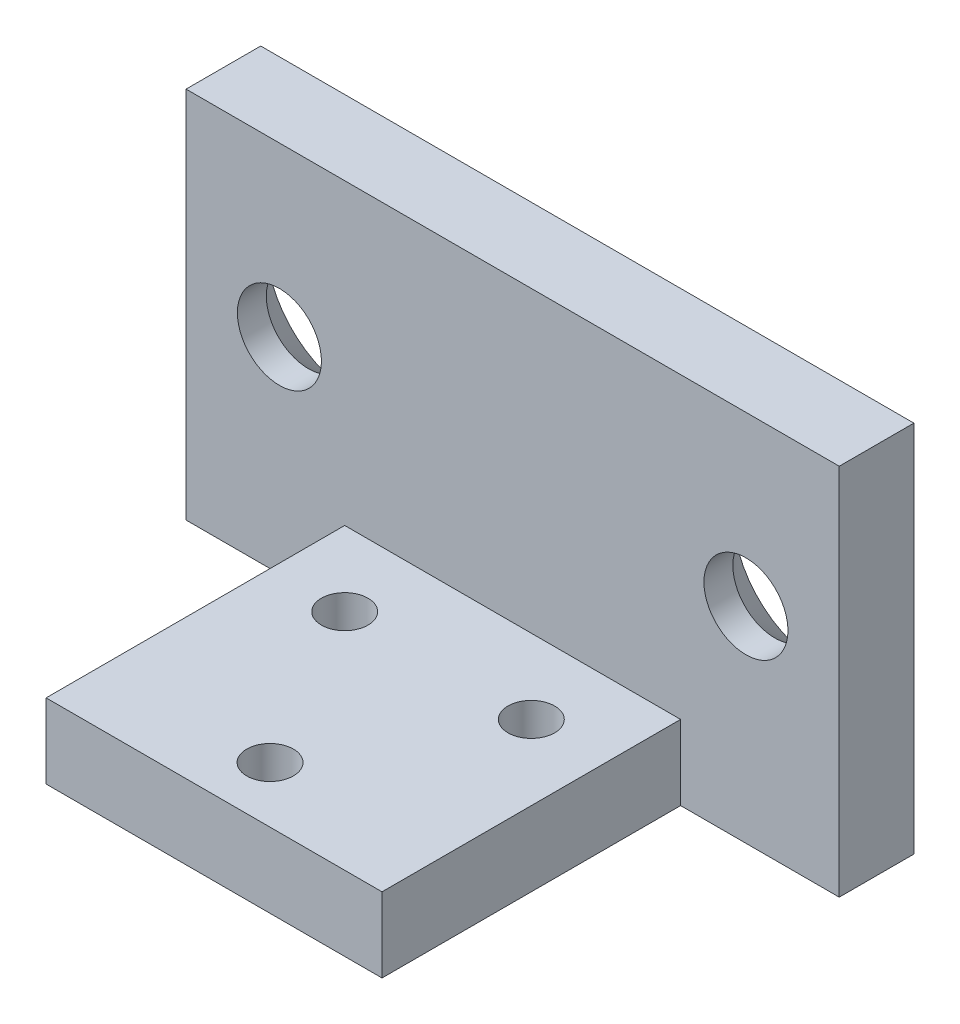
ISO-10303-21;
HEADER;
FILE_DESCRIPTION(('STEP AP214'),'2;1');
FILE_NAME('part.step','',(''),(''),'','','');
FILE_SCHEMA(('AUTOMOTIVE_DESIGN { 1 0 10303 214 1 1 1 1 }'));
ENDSEC;
DATA;
#1=APPLICATION_CONTEXT('core data for automotive mechanical design processes');
#2=APPLICATION_PROTOCOL_DEFINITION('international standard','automotive_design',2000,#1);
#3=PRODUCT_CONTEXT('',#1,'mechanical');
#4=PRODUCT('Part','Part','',(#3));
#5=PRODUCT_RELATED_PRODUCT_CATEGORY('part','',(#4));
#6=PRODUCT_DEFINITION_FORMATION('','',#4);
#7=PRODUCT_DEFINITION_CONTEXT('part definition',#1,'design');
#8=PRODUCT_DEFINITION('design','',#6,#7);
#9=PRODUCT_DEFINITION_SHAPE('','',#8);
#10=(LENGTH_UNIT() NAMED_UNIT(*) SI_UNIT(.MILLI.,.METRE.));
#11=(NAMED_UNIT(*) PLANE_ANGLE_UNIT() SI_UNIT($,.RADIAN.));
#12=(NAMED_UNIT(*) SI_UNIT($,.STERADIAN.) SOLID_ANGLE_UNIT());
#13=UNCERTAINTY_MEASURE_WITH_UNIT(LENGTH_MEASURE(1.E-05),#10,'distance_accuracy_value','');
#14=(GEOMETRIC_REPRESENTATION_CONTEXT(3) GLOBAL_UNCERTAINTY_ASSIGNED_CONTEXT((#13)) GLOBAL_UNIT_ASSIGNED_CONTEXT((#10,
#11,#12)) REPRESENTATION_CONTEXT('',''));
#15=CARTESIAN_POINT('',(0.,0.,0.));
#16=DIRECTION('',(0.,0.,1.));
#17=DIRECTION('',(1.,0.,0.));
#18=AXIS2_PLACEMENT_3D('',#15,#16,#17);
#19=CARTESIAN_POINT('',(0.,20.,4.));
#20=DIRECTION('',(0.,0.,-1.));
#21=DIRECTION('',(-1.,0.,0.));
#22=AXIS2_PLACEMENT_3D('',#19,#20,#21);
#23=PLANE('',#22);
#24=CARTESIAN_POINT('',(5.00000000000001,11.,4.));
#25=DIRECTION('',(0.,0.,-1.));
#26=DIRECTION('',(-1.,0.,0.));
#27=AXIS2_PLACEMENT_3D('',#24,#25,#26);
#28=CIRCLE('',#27,2.25);
#29=CARTESIAN_POINT('',(2.75000000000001,11.,4.));
#30=VERTEX_POINT('',#29);
#31=EDGE_CURVE('E238',#30,#30,#28,.T.);
#32=ORIENTED_EDGE('',*,*,#31,.T.);
#33=EDGE_LOOP('',(#32));
#34=FACE_BOUND('',#33,.T.);
#35=CARTESIAN_POINT('',(30.,11.,4.));
#36=DIRECTION('',(0.,0.,-1.));
#37=DIRECTION('',(-1.,0.,0.));
#38=AXIS2_PLACEMENT_3D('',#35,#36,#37);
#39=CIRCLE('',#38,2.25);
#40=CARTESIAN_POINT('',(27.75,11.,4.));
#41=VERTEX_POINT('',#40);
#42=EDGE_CURVE('E174',#41,#41,#39,.T.);
#43=ORIENTED_EDGE('',*,*,#42,.T.);
#44=EDGE_LOOP('',(#43));
#45=FACE_BOUND('',#44,.T.);
#46=DIRECTION('',(0.,-1.,0.));
#47=VECTOR('',#46,1.);
#48=CARTESIAN_POINT('',(8.50000000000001,0.,4.));
#49=LINE('',#48,#47);
#50=CARTESIAN_POINT('',(8.50000000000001,4.00000000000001,4.));
#51=VERTEX_POINT('',#50);
#52=CARTESIAN_POINT('',(8.50000000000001,0.,4.));
#53=VERTEX_POINT('',#52);
#54=EDGE_CURVE('E47',#51,#53,#49,.T.);
#55=ORIENTED_EDGE('',*,*,#54,.F.);
#56=DIRECTION('',(-1.,0.,0.));
#57=VECTOR('',#56,1.);
#58=CARTESIAN_POINT('',(8.50000000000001,4.00000000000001,4.));
#59=LINE('',#58,#57);
#60=CARTESIAN_POINT('',(26.5,4.00000000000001,4.));
#61=VERTEX_POINT('',#60);
#62=EDGE_CURVE('E93',#61,#51,#59,.T.);
#63=ORIENTED_EDGE('',*,*,#62,.F.);
#64=DIRECTION('',(0.,1.,0.));
#65=VECTOR('',#64,1.);
#66=CARTESIAN_POINT('',(26.5,0.,4.));
#67=LINE('',#66,#65);
#68=CARTESIAN_POINT('',(26.5,0.,4.));
#69=VERTEX_POINT('',#68);
#70=EDGE_CURVE('E53',#69,#61,#67,.T.);
#71=ORIENTED_EDGE('',*,*,#70,.F.);
#72=DIRECTION('',(1.,0.,0.));
#73=VECTOR('',#72,1.);
#74=CARTESIAN_POINT('',(0.,0.,4.));
#75=LINE('',#74,#73);
#76=CARTESIAN_POINT('',(35.,0.,3.99999999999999));
#77=VERTEX_POINT('',#76);
#78=EDGE_CURVE('E131',#69,#77,#75,.T.);
#79=ORIENTED_EDGE('',*,*,#78,.T.);
#80=DIRECTION('',(0.,1.,0.));
#81=VECTOR('',#80,1.);
#82=CARTESIAN_POINT('',(35.,0.,3.99999999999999));
#83=LINE('',#82,#81);
#84=CARTESIAN_POINT('',(35.,20.,4.));
#85=VERTEX_POINT('',#84);
#86=EDGE_CURVE('E134',#77,#85,#83,.T.);
#87=ORIENTED_EDGE('',*,*,#86,.T.);
#88=DIRECTION('',(-1.,0.,0.));
#89=VECTOR('',#88,1.);
#90=CARTESIAN_POINT('',(0.,20.,4.));
#91=LINE('',#90,#89);
#92=CARTESIAN_POINT('',(0.,20.,4.));
#93=VERTEX_POINT('',#92);
#94=EDGE_CURVE('E148',#85,#93,#91,.T.);
#95=ORIENTED_EDGE('',*,*,#94,.T.);
#96=DIRECTION('',(0.,-1.,0.));
#97=VECTOR('',#96,1.);
#98=CARTESIAN_POINT('',(0.,0.,4.));
#99=LINE('',#98,#97);
#100=CARTESIAN_POINT('',(0.,0.,4.));
#101=VERTEX_POINT('',#100);
#102=EDGE_CURVE('E128',#93,#101,#99,.T.);
#103=ORIENTED_EDGE('',*,*,#102,.T.);
#104=EDGE_CURVE('E139',#101,#53,#75,.T.);
#105=ORIENTED_EDGE('',*,*,#104,.T.);
#106=EDGE_LOOP('',(#55,#63,#71,#79,#87,#95,#103,#105));
#107=FACE_BOUND('',#106,.T.);
#108=ADVANCED_FACE('F30',(#34,#45,#107),#23,.F.);
#109=CARTESIAN_POINT('',(0.,0.,4.));
#110=DIRECTION('',(1.,0.,0.));
#111=DIRECTION('',(0.,0.,-1.));
#112=AXIS2_PLACEMENT_3D('',#109,#110,#111);
#113=PLANE('',#112);
#114=DIRECTION('',(0.,-1.,0.));
#115=VECTOR('',#114,1.);
#116=CARTESIAN_POINT('',(0.,0.,0.));
#117=LINE('',#116,#115);
#118=CARTESIAN_POINT('',(0.,20.,0.));
#119=VERTEX_POINT('',#118);
#120=CARTESIAN_POINT('',(0.,0.,0.));
#121=VERTEX_POINT('',#120);
#122=EDGE_CURVE('E119',#119,#121,#117,.T.);
#123=ORIENTED_EDGE('',*,*,#122,.T.);
#124=DIRECTION('',(0.,0.,-1.));
#125=VECTOR('',#124,1.);
#126=CARTESIAN_POINT('',(0.,0.,4.));
#127=LINE('',#126,#125);
#128=EDGE_CURVE('E11',#101,#121,#127,.T.);
#129=ORIENTED_EDGE('',*,*,#128,.F.);
#130=ORIENTED_EDGE('',*,*,#102,.F.);
#131=DIRECTION('',(0.,0.,-1.));
#132=VECTOR('',#131,1.);
#133=CARTESIAN_POINT('',(0.,20.,4.));
#134=LINE('',#133,#132);
#135=EDGE_CURVE('E146',#93,#119,#134,.T.);
#136=ORIENTED_EDGE('',*,*,#135,.T.);
#137=EDGE_LOOP('',(#123,#129,#130,#136));
#138=FACE_BOUND('',#137,.T.);
#139=ADVANCED_FACE('F32',(#138),#113,.F.);
#140=CARTESIAN_POINT('',(0.,0.,4.));
#141=DIRECTION('',(0.,1.,0.));
#142=DIRECTION('',(0.,0.,1.));
#143=AXIS2_PLACEMENT_3D('',#140,#141,#142);
#144=PLANE('',#143);
#145=CARTESIAN_POINT('',(12.5,0.,8.));
#146=DIRECTION('',(0.,1.,0.));
#147=DIRECTION('',(0.,0.,1.));
#148=AXIS2_PLACEMENT_3D('',#145,#146,#147);
#149=CIRCLE('',#148,1.25);
#150=CARTESIAN_POINT('',(12.5,0.,9.25));
#151=VERTEX_POINT('',#150);
#152=EDGE_CURVE('E34',#151,#151,#149,.T.);
#153=ORIENTED_EDGE('',*,*,#152,.T.);
#154=EDGE_LOOP('',(#153));
#155=FACE_BOUND('',#154,.T.);
#156=CARTESIAN_POINT('',(22.5,0.,7.99999999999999));
#157=DIRECTION('',(0.,1.,0.));
#158=DIRECTION('',(0.,0.,1.));
#159=AXIS2_PLACEMENT_3D('',#156,#157,#158);
#160=CIRCLE('',#159,1.25);
#161=CARTESIAN_POINT('',(22.5,0.,9.24999999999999));
#162=VERTEX_POINT('',#161);
#163=EDGE_CURVE('E225',#162,#162,#160,.T.);
#164=ORIENTED_EDGE('',*,*,#163,.T.);
#165=EDGE_LOOP('',(#164));
#166=FACE_BOUND('',#165,.T.);
#167=CARTESIAN_POINT('',(17.5,0.,17.));
#168=DIRECTION('',(0.,1.,0.));
#169=DIRECTION('',(0.,0.,1.));
#170=AXIS2_PLACEMENT_3D('',#167,#168,#169);
#171=CIRCLE('',#170,1.25);
#172=CARTESIAN_POINT('',(17.5,0.,18.25));
#173=VERTEX_POINT('',#172);
#174=EDGE_CURVE('E228',#173,#173,#171,.T.);
#175=ORIENTED_EDGE('',*,*,#174,.T.);
#176=EDGE_LOOP('',(#175));
#177=FACE_BOUND('',#176,.T.);
#178=DIRECTION('',(1.,0.,0.));
#179=VECTOR('',#178,1.);
#180=CARTESIAN_POINT('',(0.,0.,0.));
#181=LINE('',#180,#179);
#182=CARTESIAN_POINT('',(35.,0.,0.));
#183=VERTEX_POINT('',#182);
#184=EDGE_CURVE('E122',#121,#183,#181,.T.);
#185=ORIENTED_EDGE('',*,*,#184,.T.);
#186=DIRECTION('',(0.,0.,-1.));
#187=VECTOR('',#186,1.);
#188=CARTESIAN_POINT('',(35.,0.,3.99999999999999));
#189=LINE('',#188,#187);
#190=EDGE_CURVE('E39',#77,#183,#189,.T.);
#191=ORIENTED_EDGE('',*,*,#190,.F.);
#192=ORIENTED_EDGE('',*,*,#78,.F.);
#193=DIRECTION('',(0.,0.,-1.));
#194=VECTOR('',#193,1.);
#195=CARTESIAN_POINT('',(26.5,0.,20.));
#196=LINE('',#195,#194);
#197=CARTESIAN_POINT('',(26.5,0.,20.));
#198=VERTEX_POINT('',#197);
#199=EDGE_CURVE('E108',#198,#69,#196,.T.);
#200=ORIENTED_EDGE('',*,*,#199,.F.);
#201=DIRECTION('',(1.,0.,0.));
#202=VECTOR('',#201,1.);
#203=CARTESIAN_POINT('',(8.5,0.,20.));
#204=LINE('',#203,#202);
#205=CARTESIAN_POINT('',(8.5,0.,20.));
#206=VERTEX_POINT('',#205);
#207=EDGE_CURVE('E168',#206,#198,#204,.T.);
#208=ORIENTED_EDGE('',*,*,#207,.F.);
#209=DIRECTION('',(0.,0.,-1.));
#210=VECTOR('',#209,1.);
#211=CARTESIAN_POINT('',(8.5,0.,20.));
#212=LINE('',#211,#210);
#213=EDGE_CURVE('E114',#206,#53,#212,.T.);
#214=ORIENTED_EDGE('',*,*,#213,.T.);
#215=ORIENTED_EDGE('',*,*,#104,.F.);
#216=ORIENTED_EDGE('',*,*,#128,.T.);
#217=EDGE_LOOP('',(#185,#191,#192,#200,#208,#214,#215,#216));
#218=FACE_BOUND('',#217,.T.);
#219=ADVANCED_FACE('F167',(#155,#166,#177,#218),#144,.F.);
#220=CARTESIAN_POINT('',(35.,0.,3.99999999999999));
#221=DIRECTION('',(-1.,0.,0.));
#222=DIRECTION('',(0.,0.,1.));
#223=AXIS2_PLACEMENT_3D('',#220,#221,#222);
#224=PLANE('',#223);
#225=DIRECTION('',(0.,1.,0.));
#226=VECTOR('',#225,1.);
#227=CARTESIAN_POINT('',(35.,0.,0.));
#228=LINE('',#227,#226);
#229=CARTESIAN_POINT('',(35.,20.,0.));
#230=VERTEX_POINT('',#229);
#231=EDGE_CURVE('E124',#183,#230,#228,.T.);
#232=ORIENTED_EDGE('',*,*,#231,.T.);
#233=DIRECTION('',(0.,0.,-1.));
#234=VECTOR('',#233,1.);
#235=CARTESIAN_POINT('',(35.,20.,4.));
#236=LINE('',#235,#234);
#237=EDGE_CURVE('E143',#85,#230,#236,.T.);
#238=ORIENTED_EDGE('',*,*,#237,.F.);
#239=ORIENTED_EDGE('',*,*,#86,.F.);
#240=ORIENTED_EDGE('',*,*,#190,.T.);
#241=EDGE_LOOP('',(#232,#238,#239,#240));
#242=FACE_BOUND('',#241,.T.);
#243=ADVANCED_FACE('F155',(#242),#224,.F.);
#244=CARTESIAN_POINT('',(0.,20.,4.));
#245=DIRECTION('',(0.,-1.,0.));
#246=DIRECTION('',(0.,0.,-1.));
#247=AXIS2_PLACEMENT_3D('',#244,#245,#246);
#248=PLANE('',#247);
#249=DIRECTION('',(-1.,0.,0.));
#250=VECTOR('',#249,1.);
#251=CARTESIAN_POINT('',(0.,20.,0.));
#252=LINE('',#251,#250);
#253=EDGE_CURVE('E126',#230,#119,#252,.T.);
#254=ORIENTED_EDGE('',*,*,#253,.T.);
#255=ORIENTED_EDGE('',*,*,#135,.F.);
#256=ORIENTED_EDGE('',*,*,#94,.F.);
#257=ORIENTED_EDGE('',*,*,#237,.T.);
#258=EDGE_LOOP('',(#254,#255,#256,#257));
#259=FACE_BOUND('',#258,.T.);
#260=ADVANCED_FACE('F159',(#259),#248,.F.);
#261=CARTESIAN_POINT('',(0.,20.,0.));
#262=DIRECTION('',(0.,0.,-1.));
#263=DIRECTION('',(-1.,0.,0.));
#264=AXIS2_PLACEMENT_3D('',#261,#262,#263);
#265=PLANE('',#264);
#266=CARTESIAN_POINT('',(5.00000000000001,11.,0.));
#267=DIRECTION('',(0.,0.,-1.));
#268=DIRECTION('',(-1.,0.,0.));
#269=AXIS2_PLACEMENT_3D('',#266,#267,#268);
#270=CIRCLE('',#269,4.7);
#271=CARTESIAN_POINT('',(0.300000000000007,11.,0.));
#272=VERTEX_POINT('',#271);
#273=EDGE_CURVE('E234',#272,#272,#270,.T.);
#274=ORIENTED_EDGE('',*,*,#273,.F.);
#275=EDGE_LOOP('',(#274));
#276=FACE_BOUND('',#275,.T.);
#277=CARTESIAN_POINT('',(30.,11.,0.));
#278=DIRECTION('',(0.,0.,-1.));
#279=DIRECTION('',(-1.,0.,0.));
#280=AXIS2_PLACEMENT_3D('',#277,#278,#279);
#281=CIRCLE('',#280,4.7);
#282=CARTESIAN_POINT('',(25.3,11.,0.));
#283=VERTEX_POINT('',#282);
#284=EDGE_CURVE('E177',#283,#283,#281,.T.);
#285=ORIENTED_EDGE('',*,*,#284,.F.);
#286=EDGE_LOOP('',(#285));
#287=FACE_BOUND('',#286,.T.);
#288=ORIENTED_EDGE('',*,*,#122,.F.);
#289=ORIENTED_EDGE('',*,*,#253,.F.);
#290=ORIENTED_EDGE('',*,*,#231,.F.);
#291=ORIENTED_EDGE('',*,*,#184,.F.);
#292=EDGE_LOOP('',(#288,#289,#290,#291));
#293=FACE_BOUND('',#292,.T.);
#294=ADVANCED_FACE('F193',(#276,#287,#293),#265,.T.);
#295=CARTESIAN_POINT('',(8.5,0.,20.));
#296=DIRECTION('',(1.,0.,0.));
#297=DIRECTION('',(0.,0.,-1.));
#298=AXIS2_PLACEMENT_3D('',#295,#296,#297);
#299=PLANE('',#298);
#300=ORIENTED_EDGE('',*,*,#54,.T.);
#301=ORIENTED_EDGE('',*,*,#213,.F.);
#302=DIRECTION('',(0.,-1.,0.));
#303=VECTOR('',#302,1.);
#304=CARTESIAN_POINT('',(8.5,0.,20.));
#305=LINE('',#304,#303);
#306=CARTESIAN_POINT('',(8.5,4.00000000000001,20.));
#307=VERTEX_POINT('',#306);
#308=EDGE_CURVE('E98',#307,#206,#305,.T.);
#309=ORIENTED_EDGE('',*,*,#308,.F.);
#310=DIRECTION('',(0.,0.,-1.));
#311=VECTOR('',#310,1.);
#312=CARTESIAN_POINT('',(8.5,4.00000000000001,20.));
#313=LINE('',#312,#311);
#314=EDGE_CURVE('E112',#307,#51,#313,.T.);
#315=ORIENTED_EDGE('',*,*,#314,.T.);
#316=EDGE_LOOP('',(#300,#301,#309,#315));
#317=FACE_BOUND('',#316,.T.);
#318=ADVANCED_FACE('F173',(#317),#299,.F.);
#319=CARTESIAN_POINT('',(26.5,0.,20.));
#320=DIRECTION('',(-1.,0.,0.));
#321=DIRECTION('',(0.,0.,1.));
#322=AXIS2_PLACEMENT_3D('',#319,#320,#321);
#323=PLANE('',#322);
#324=ORIENTED_EDGE('',*,*,#70,.T.);
#325=DIRECTION('',(0.,0.,-1.));
#326=VECTOR('',#325,1.);
#327=CARTESIAN_POINT('',(26.5,4.00000000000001,20.));
#328=LINE('',#327,#326);
#329=CARTESIAN_POINT('',(26.5,4.00000000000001,20.));
#330=VERTEX_POINT('',#329);
#331=EDGE_CURVE('E105',#330,#61,#328,.T.);
#332=ORIENTED_EDGE('',*,*,#331,.F.);
#333=DIRECTION('',(0.,1.,0.));
#334=VECTOR('',#333,1.);
#335=CARTESIAN_POINT('',(26.5,0.,20.));
#336=LINE('',#335,#334);
#337=EDGE_CURVE('E189',#198,#330,#336,.T.);
#338=ORIENTED_EDGE('',*,*,#337,.F.);
#339=ORIENTED_EDGE('',*,*,#199,.T.);
#340=EDGE_LOOP('',(#324,#332,#338,#339));
#341=FACE_BOUND('',#340,.T.);
#342=ADVANCED_FACE('F103',(#341),#323,.F.);
#343=CARTESIAN_POINT('',(8.5,4.00000000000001,20.));
#344=DIRECTION('',(0.,-1.,0.));
#345=DIRECTION('',(1.,0.,0.));
#346=AXIS2_PLACEMENT_3D('',#343,#344,#345);
#347=PLANE('',#346);
#348=CARTESIAN_POINT('',(12.5,4.00000000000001,8.));
#349=DIRECTION('',(0.,1.,0.));
#350=DIRECTION('',(0.,0.,1.));
#351=AXIS2_PLACEMENT_3D('',#348,#349,#350);
#352=CIRCLE('',#351,1.25);
#353=CARTESIAN_POINT('',(12.5,4.00000000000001,9.25));
#354=VERTEX_POINT('',#353);
#355=EDGE_CURVE('E244',#354,#354,#352,.T.);
#356=ORIENTED_EDGE('',*,*,#355,.F.);
#357=EDGE_LOOP('',(#356));
#358=FACE_BOUND('',#357,.T.);
#359=CARTESIAN_POINT('',(22.5,4.00000000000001,8.));
#360=DIRECTION('',(0.,1.,0.));
#361=DIRECTION('',(0.,0.,1.));
#362=AXIS2_PLACEMENT_3D('',#359,#360,#361);
#363=CIRCLE('',#362,1.25);
#364=CARTESIAN_POINT('',(22.5,4.00000000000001,9.24999999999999));
#365=VERTEX_POINT('',#364);
#366=EDGE_CURVE('E239',#365,#365,#363,.T.);
#367=ORIENTED_EDGE('',*,*,#366,.F.);
#368=EDGE_LOOP('',(#367));
#369=FACE_BOUND('',#368,.T.);
#370=CARTESIAN_POINT('',(17.5,4.00000000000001,17.));
#371=DIRECTION('',(0.,1.,0.));
#372=DIRECTION('',(0.,0.,1.));
#373=AXIS2_PLACEMENT_3D('',#370,#371,#372);
#374=CIRCLE('',#373,1.25);
#375=CARTESIAN_POINT('',(17.5,4.00000000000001,18.25));
#376=VERTEX_POINT('',#375);
#377=EDGE_CURVE('E231',#376,#376,#374,.T.);
#378=ORIENTED_EDGE('',*,*,#377,.F.);
#379=EDGE_LOOP('',(#378));
#380=FACE_BOUND('',#379,.T.);
#381=ORIENTED_EDGE('',*,*,#62,.T.);
#382=ORIENTED_EDGE('',*,*,#314,.F.);
#383=DIRECTION('',(-1.,0.,0.));
#384=VECTOR('',#383,1.);
#385=CARTESIAN_POINT('',(8.5,4.00000000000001,20.));
#386=LINE('',#385,#384);
#387=EDGE_CURVE('E111',#330,#307,#386,.T.);
#388=ORIENTED_EDGE('',*,*,#387,.F.);
#389=ORIENTED_EDGE('',*,*,#331,.T.);
#390=EDGE_LOOP('',(#381,#382,#388,#389));
#391=FACE_BOUND('',#390,.T.);
#392=ADVANCED_FACE('F110',(#358,#369,#380,#391),#347,.F.);
#393=CARTESIAN_POINT('',(8.5,0.,20.));
#394=DIRECTION('',(0.,0.,-1.));
#395=DIRECTION('',(-1.,0.,0.));
#396=AXIS2_PLACEMENT_3D('',#393,#394,#395);
#397=PLANE('',#396);
#398=ORIENTED_EDGE('',*,*,#308,.T.);
#399=ORIENTED_EDGE('',*,*,#207,.T.);
#400=ORIENTED_EDGE('',*,*,#337,.T.);
#401=ORIENTED_EDGE('',*,*,#387,.T.);
#402=EDGE_LOOP('',(#398,#399,#400,#401));
#403=FACE_BOUND('',#402,.T.);
#404=ADVANCED_FACE('F191',(#403),#397,.F.);
#405=CARTESIAN_POINT('',(30.,11.,0.));
#406=DIRECTION('',(0.,0.,-1.));
#407=DIRECTION('',(-1.,0.,0.));
#408=AXIS2_PLACEMENT_3D('',#405,#406,#407);
#409=CYLINDRICAL_SURFACE('',#408,2.25);
#410=CARTESIAN_POINT('',(30.,11.,2.45));
#411=DIRECTION('',(0.,0.,-1.));
#412=DIRECTION('',(-1.,0.,0.));
#413=AXIS2_PLACEMENT_3D('',#410,#411,#412);
#414=CIRCLE('',#413,2.25);
#415=CARTESIAN_POINT('',(27.75,11.,2.45));
#416=VERTEX_POINT('',#415);
#417=EDGE_CURVE('E248',#416,#416,#414,.T.);
#418=ORIENTED_EDGE('',*,*,#417,.T.);
#419=EDGE_LOOP('',(#418));
#420=FACE_BOUND('',#419,.T.);
#421=ORIENTED_EDGE('',*,*,#42,.F.);
#422=EDGE_LOOP('',(#421));
#423=FACE_BOUND('',#422,.T.);
#424=ADVANCED_FACE('F268',(#420,#423),#409,.F.);
#425=CARTESIAN_POINT('',(30.,11.,0.));
#426=DIRECTION('',(0.,0.,-1.));
#427=DIRECTION('',(-1.,0.,0.));
#428=AXIS2_PLACEMENT_3D('',#425,#426,#427);
#429=CONICAL_SURFACE('',#428,4.7,0.785398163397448);
#430=ORIENTED_EDGE('',*,*,#417,.F.);
#431=EDGE_LOOP('',(#430));
#432=FACE_BOUND('',#431,.T.);
#433=ORIENTED_EDGE('',*,*,#284,.T.);
#434=EDGE_LOOP('',(#433));
#435=FACE_BOUND('',#434,.T.);
#436=ADVANCED_FACE('F258',(#432,#435),#429,.F.);
#437=CARTESIAN_POINT('',(5.00000000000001,11.,0.));
#438=DIRECTION('',(0.,0.,-1.));
#439=DIRECTION('',(-1.,0.,0.));
#440=AXIS2_PLACEMENT_3D('',#437,#438,#439);
#441=CYLINDRICAL_SURFACE('',#440,2.25);
#442=CARTESIAN_POINT('',(5.00000000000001,11.,2.45));
#443=DIRECTION('',(0.,0.,-1.));
#444=DIRECTION('',(-1.,0.,0.));
#445=AXIS2_PLACEMENT_3D('',#442,#443,#444);
#446=CIRCLE('',#445,2.25);
#447=CARTESIAN_POINT('',(2.75000000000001,11.,2.45));
#448=VERTEX_POINT('',#447);
#449=EDGE_CURVE('E230',#448,#448,#446,.T.);
#450=ORIENTED_EDGE('',*,*,#449,.T.);
#451=EDGE_LOOP('',(#450));
#452=FACE_BOUND('',#451,.T.);
#453=ORIENTED_EDGE('',*,*,#31,.F.);
#454=EDGE_LOOP('',(#453));
#455=FACE_BOUND('',#454,.T.);
#456=ADVANCED_FACE('F255',(#452,#455),#441,.F.);
#457=CARTESIAN_POINT('',(5.00000000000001,11.,0.));
#458=DIRECTION('',(0.,0.,-1.));
#459=DIRECTION('',(-1.,0.,0.));
#460=AXIS2_PLACEMENT_3D('',#457,#458,#459);
#461=CONICAL_SURFACE('',#460,4.7,0.785398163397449);
#462=ORIENTED_EDGE('',*,*,#449,.F.);
#463=EDGE_LOOP('',(#462));
#464=FACE_BOUND('',#463,.T.);
#465=ORIENTED_EDGE('',*,*,#273,.T.);
#466=EDGE_LOOP('',(#465));
#467=FACE_BOUND('',#466,.T.);
#468=ADVANCED_FACE('F257',(#464,#467),#461,.F.);
#469=CARTESIAN_POINT('',(17.5,4.00000000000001,17.));
#470=DIRECTION('',(0.,1.,0.));
#471=DIRECTION('',(0.,0.,1.));
#472=AXIS2_PLACEMENT_3D('',#469,#470,#471);
#473=CYLINDRICAL_SURFACE('',#472,1.25);
#474=ORIENTED_EDGE('',*,*,#377,.T.);
#475=EDGE_LOOP('',(#474));
#476=FACE_BOUND('',#475,.T.);
#477=ORIENTED_EDGE('',*,*,#174,.F.);
#478=EDGE_LOOP('',(#477));
#479=FACE_BOUND('',#478,.T.);
#480=ADVANCED_FACE('F265',(#476,#479),#473,.F.);
#481=CARTESIAN_POINT('',(22.5,4.00000000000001,8.));
#482=DIRECTION('',(0.,1.,0.));
#483=DIRECTION('',(0.,0.,1.));
#484=AXIS2_PLACEMENT_3D('',#481,#482,#483);
#485=CYLINDRICAL_SURFACE('',#484,1.25);
#486=ORIENTED_EDGE('',*,*,#366,.T.);
#487=EDGE_LOOP('',(#486));
#488=FACE_BOUND('',#487,.T.);
#489=ORIENTED_EDGE('',*,*,#163,.F.);
#490=EDGE_LOOP('',(#489));
#491=FACE_BOUND('',#490,.T.);
#492=ADVANCED_FACE('F321',(#488,#491),#485,.F.);
#493=CARTESIAN_POINT('',(12.5,4.00000000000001,8.));
#494=DIRECTION('',(0.,1.,0.));
#495=DIRECTION('',(0.,0.,1.));
#496=AXIS2_PLACEMENT_3D('',#493,#494,#495);
#497=CYLINDRICAL_SURFACE('',#496,1.25);
#498=ORIENTED_EDGE('',*,*,#355,.T.);
#499=EDGE_LOOP('',(#498));
#500=FACE_BOUND('',#499,.T.);
#501=ORIENTED_EDGE('',*,*,#152,.F.);
#502=EDGE_LOOP('',(#501));
#503=FACE_BOUND('',#502,.T.);
#504=ADVANCED_FACE('F330',(#500,#503),#497,.F.);
#505=CLOSED_SHELL('',(#108,#139,#219,#243,#260,#294,#318,#342,#392,#404,#424,#436,#456,#468,
#480,#492,#504));
#506=MANIFOLD_SOLID_BREP('B2',#505);
#507=ADVANCED_BREP_SHAPE_REPRESENTATION('',(#18,#506),#14);
#508=SHAPE_DEFINITION_REPRESENTATION(#9,#507);
ENDSEC;
END-ISO-10303-21;
